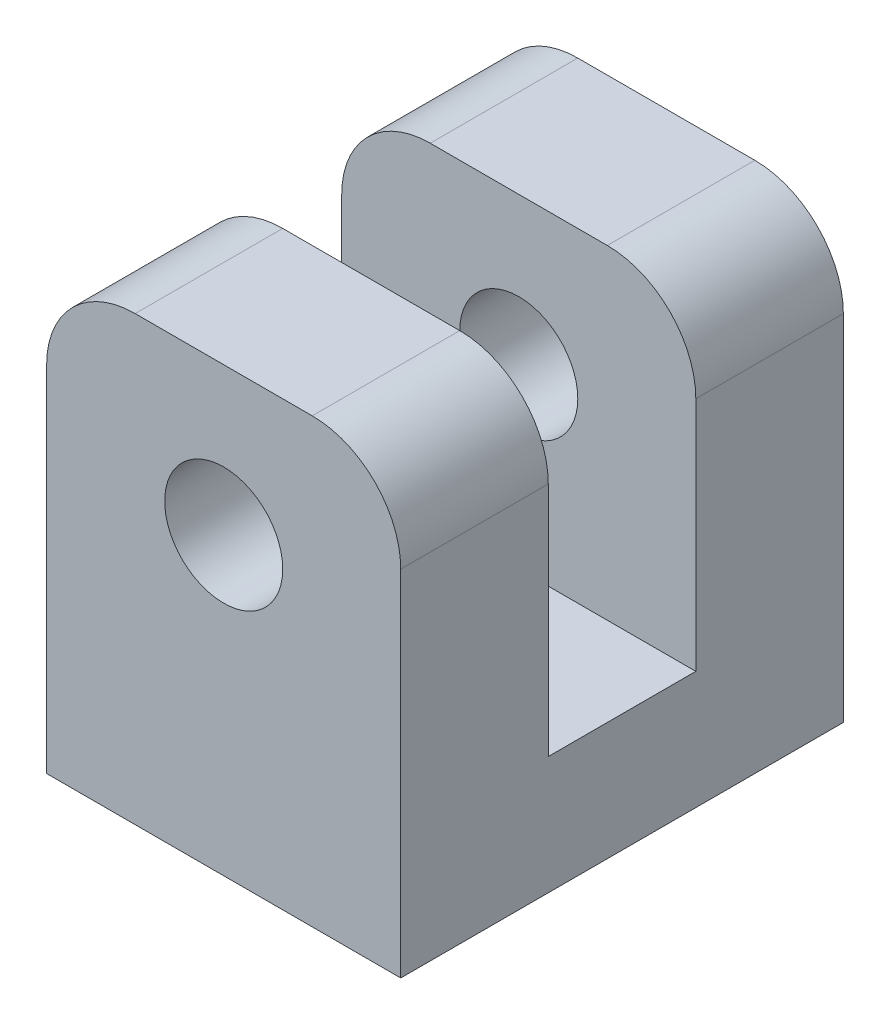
ISO-10303-21;
HEADER;
FILE_DESCRIPTION(('STEP AP214'),'2;1');
FILE_NAME('part.step','',(''),(''),'','','');
FILE_SCHEMA(('AUTOMOTIVE_DESIGN { 1 0 10303 214 1 1 1 1 }'));
ENDSEC;
DATA;
#1=APPLICATION_CONTEXT('core data for automotive mechanical design processes');
#2=APPLICATION_PROTOCOL_DEFINITION('international standard','automotive_design',2000,#1);
#3=PRODUCT_CONTEXT('',#1,'mechanical');
#4=PRODUCT('Part','Part','',(#3));
#5=PRODUCT_RELATED_PRODUCT_CATEGORY('part','',(#4));
#6=PRODUCT_DEFINITION_FORMATION('','',#4);
#7=PRODUCT_DEFINITION_CONTEXT('part definition',#1,'design');
#8=PRODUCT_DEFINITION('design','',#6,#7);
#9=PRODUCT_DEFINITION_SHAPE('','',#8);
#10=(LENGTH_UNIT() NAMED_UNIT(*) SI_UNIT(.MILLI.,.METRE.));
#11=(NAMED_UNIT(*) PLANE_ANGLE_UNIT() SI_UNIT($,.RADIAN.));
#12=(NAMED_UNIT(*) SI_UNIT($,.STERADIAN.) SOLID_ANGLE_UNIT());
#13=UNCERTAINTY_MEASURE_WITH_UNIT(LENGTH_MEASURE(1.E-05),#10,'distance_accuracy_value','');
#14=(GEOMETRIC_REPRESENTATION_CONTEXT(3) GLOBAL_UNCERTAINTY_ASSIGNED_CONTEXT((#13)) GLOBAL_UNIT_ASSIGNED_CONTEXT((#10,
#11,#12)) REPRESENTATION_CONTEXT('',''));
#15=CARTESIAN_POINT('',(0.,0.,0.));
#16=DIRECTION('',(0.,0.,1.));
#17=DIRECTION('',(1.,0.,0.));
#18=AXIS2_PLACEMENT_3D('',#15,#16,#17);
#19=CARTESIAN_POINT('',(0.,150.,150.));
#20=DIRECTION('',(0.,-1.,0.));
#21=DIRECTION('',(0.,0.,-1.));
#22=AXIS2_PLACEMENT_3D('',#19,#20,#21);
#23=PLANE('',#22);
#24=DIRECTION('',(-1.,0.,0.));
#25=VECTOR('',#24,1.);
#26=CARTESIAN_POINT('',(0.,150.,50.));
#27=LINE('',#26,#25);
#28=CARTESIAN_POINT('',(90.,150.,50.));
#29=VERTEX_POINT('',#28);
#30=CARTESIAN_POINT('',(30.,150.,50.));
#31=VERTEX_POINT('',#30);
#32=EDGE_CURVE('E143',#29,#31,#27,.T.);
#33=ORIENTED_EDGE('',*,*,#32,.F.);
#34=DIRECTION('',(0.,0.,-1.));
#35=VECTOR('',#34,1.);
#36=CARTESIAN_POINT('',(90.,150.,150.));
#37=LINE('',#36,#35);
#38=CARTESIAN_POINT('',(90.,150.,0.));
#39=VERTEX_POINT('',#38);
#40=EDGE_CURVE('E185',#29,#39,#37,.T.);
#41=ORIENTED_EDGE('',*,*,#40,.T.);
#42=DIRECTION('',(-1.,0.,0.));
#43=VECTOR('',#42,1.);
#44=CARTESIAN_POINT('',(0.,150.,0.));
#45=LINE('',#44,#43);
#46=CARTESIAN_POINT('',(30.,150.,0.));
#47=VERTEX_POINT('',#46);
#48=EDGE_CURVE('E155',#39,#47,#45,.T.);
#49=ORIENTED_EDGE('',*,*,#48,.T.);
#50=DIRECTION('',(0.,0.,-1.));
#51=VECTOR('',#50,1.);
#52=CARTESIAN_POINT('',(30.,150.,150.));
#53=LINE('',#52,#51);
#54=EDGE_CURVE('E178',#47,#31,#53,.F.);
#55=ORIENTED_EDGE('',*,*,#54,.T.);
#56=EDGE_LOOP('',(#33,#41,#49,#55));
#57=FACE_BOUND('',#56,.T.);
#58=ADVANCED_FACE('F33',(#57),#23,.F.);
#59=CARTESIAN_POINT('',(0.,0.,150.));
#60=DIRECTION('',(1.,0.,0.));
#61=DIRECTION('',(0.,0.,-1.));
#62=AXIS2_PLACEMENT_3D('',#59,#60,#61);
#63=PLANE('',#62);
#64=DIRECTION('',(0.,-1.,0.));
#65=VECTOR('',#64,1.);
#66=CARTESIAN_POINT('',(0.,0.,150.));
#67=LINE('',#66,#65);
#68=CARTESIAN_POINT('',(0.,120.,150.));
#69=VERTEX_POINT('',#68);
#70=CARTESIAN_POINT('',(0.,0.,150.));
#71=VERTEX_POINT('',#70);
#72=EDGE_CURVE('E152',#69,#71,#67,.T.);
#73=ORIENTED_EDGE('',*,*,#72,.F.);
#74=DIRECTION('',(0.,0.,-1.));
#75=VECTOR('',#74,1.);
#76=CARTESIAN_POINT('',(0.,120.,150.));
#77=LINE('',#76,#75);
#78=CARTESIAN_POINT('',(0.,120.,100.));
#79=VERTEX_POINT('',#78);
#80=EDGE_CURVE('E11',#69,#79,#77,.T.);
#81=ORIENTED_EDGE('',*,*,#80,.T.);
#82=DIRECTION('',(0.,1.,0.));
#83=VECTOR('',#82,1.);
#84=CARTESIAN_POINT('',(0.,40.,100.));
#85=LINE('',#84,#83);
#86=CARTESIAN_POINT('',(0.,40.,100.));
#87=VERTEX_POINT('',#86);
#88=EDGE_CURVE('E128',#87,#79,#85,.T.);
#89=ORIENTED_EDGE('',*,*,#88,.F.);
#90=DIRECTION('',(0.,0.,1.));
#91=VECTOR('',#90,1.);
#92=CARTESIAN_POINT('',(0.,40.,50.));
#93=LINE('',#92,#91);
#94=CARTESIAN_POINT('',(0.,40.,50.));
#95=VERTEX_POINT('',#94);
#96=EDGE_CURVE('E134',#95,#87,#93,.T.);
#97=ORIENTED_EDGE('',*,*,#96,.F.);
#98=DIRECTION('',(0.,1.,0.));
#99=VECTOR('',#98,1.);
#100=CARTESIAN_POINT('',(0.,40.,50.));
#101=LINE('',#100,#99);
#102=CARTESIAN_POINT('',(0.,120.,50.));
#103=VERTEX_POINT('',#102);
#104=EDGE_CURVE('E166',#95,#103,#101,.T.);
#105=ORIENTED_EDGE('',*,*,#104,.T.);
#106=DIRECTION('',(0.,0.,-1.));
#107=VECTOR('',#106,1.);
#108=CARTESIAN_POINT('',(0.,120.,150.));
#109=LINE('',#108,#107);
#110=CARTESIAN_POINT('',(0.,120.,0.));
#111=VERTEX_POINT('',#110);
#112=EDGE_CURVE('E41',#103,#111,#109,.T.);
#113=ORIENTED_EDGE('',*,*,#112,.T.);
#114=DIRECTION('',(0.,-1.,0.));
#115=VECTOR('',#114,1.);
#116=CARTESIAN_POINT('',(0.,0.,0.));
#117=LINE('',#116,#115);
#118=CARTESIAN_POINT('',(0.,0.,0.));
#119=VERTEX_POINT('',#118);
#120=EDGE_CURVE('E163',#111,#119,#117,.T.);
#121=ORIENTED_EDGE('',*,*,#120,.T.);
#122=DIRECTION('',(0.,0.,-1.));
#123=VECTOR('',#122,1.);
#124=CARTESIAN_POINT('',(0.,0.,150.));
#125=LINE('',#124,#123);
#126=EDGE_CURVE('E175',#71,#119,#125,.T.);
#127=ORIENTED_EDGE('',*,*,#126,.F.);
#128=EDGE_LOOP('',(#73,#81,#89,#97,#105,#113,#121,#127));
#129=FACE_BOUND('',#128,.T.);
#130=ADVANCED_FACE('F145',(#129),#63,.F.);
#131=CARTESIAN_POINT('',(0.,0.,150.));
#132=DIRECTION('',(0.,1.,0.));
#133=DIRECTION('',(0.,0.,1.));
#134=AXIS2_PLACEMENT_3D('',#131,#132,#133);
#135=PLANE('',#134);
#136=CARTESIAN_POINT('',(60.,0.,75.));
#137=DIRECTION('',(0.,-1.,0.));
#138=DIRECTION('',(0.,0.,-1.));
#139=AXIS2_PLACEMENT_3D('',#136,#137,#138);
#140=CIRCLE('',#139,30.);
#141=CARTESIAN_POINT('',(60.,0.,45.));
#142=VERTEX_POINT('',#141);
#143=EDGE_CURVE('E266',#142,#142,#140,.T.);
#144=ORIENTED_EDGE('',*,*,#143,.F.);
#145=EDGE_LOOP('',(#144));
#146=FACE_BOUND('',#145,.T.);
#147=DIRECTION('',(1.,0.,0.));
#148=VECTOR('',#147,1.);
#149=CARTESIAN_POINT('',(0.,0.,0.));
#150=LINE('',#149,#148);
#151=CARTESIAN_POINT('',(120.,0.,0.));
#152=VERTEX_POINT('',#151);
#153=EDGE_CURVE('E165',#119,#152,#150,.T.);
#154=ORIENTED_EDGE('',*,*,#153,.T.);
#155=DIRECTION('',(0.,0.,-1.));
#156=VECTOR('',#155,1.);
#157=CARTESIAN_POINT('',(120.,0.,150.));
#158=LINE('',#157,#156);
#159=CARTESIAN_POINT('',(120.,0.,150.));
#160=VERTEX_POINT('',#159);
#161=EDGE_CURVE('E162',#160,#152,#158,.T.);
#162=ORIENTED_EDGE('',*,*,#161,.F.);
#163=DIRECTION('',(1.,0.,0.));
#164=VECTOR('',#163,1.);
#165=CARTESIAN_POINT('',(0.,0.,150.));
#166=LINE('',#165,#164);
#167=EDGE_CURVE('E154',#71,#160,#166,.T.);
#168=ORIENTED_EDGE('',*,*,#167,.F.);
#169=ORIENTED_EDGE('',*,*,#126,.T.);
#170=EDGE_LOOP('',(#154,#162,#168,#169));
#171=FACE_BOUND('',#170,.T.);
#172=ADVANCED_FACE('F224',(#146,#171),#135,.F.);
#173=CARTESIAN_POINT('',(120.,0.,150.));
#174=DIRECTION('',(-1.,0.,0.));
#175=DIRECTION('',(0.,0.,1.));
#176=AXIS2_PLACEMENT_3D('',#173,#174,#175);
#177=PLANE('',#176);
#178=DIRECTION('',(0.,1.,0.));
#179=VECTOR('',#178,1.);
#180=CARTESIAN_POINT('',(120.,0.,0.));
#181=LINE('',#180,#179);
#182=CARTESIAN_POINT('',(120.,120.,0.));
#183=VERTEX_POINT('',#182);
#184=EDGE_CURVE('E168',#152,#183,#181,.T.);
#185=ORIENTED_EDGE('',*,*,#184,.T.);
#186=DIRECTION('',(0.,0.,-1.));
#187=VECTOR('',#186,1.);
#188=CARTESIAN_POINT('',(120.,120.,150.));
#189=LINE('',#188,#187);
#190=CARTESIAN_POINT('',(120.,120.,50.));
#191=VERTEX_POINT('',#190);
#192=EDGE_CURVE('E194',#183,#191,#189,.F.);
#193=ORIENTED_EDGE('',*,*,#192,.T.);
#194=DIRECTION('',(0.,1.,0.));
#195=VECTOR('',#194,1.);
#196=CARTESIAN_POINT('',(120.,40.,50.));
#197=LINE('',#196,#195);
#198=CARTESIAN_POINT('',(120.,40.,50.));
#199=VERTEX_POINT('',#198);
#200=EDGE_CURVE('E147',#199,#191,#197,.T.);
#201=ORIENTED_EDGE('',*,*,#200,.F.);
#202=DIRECTION('',(0.,0.,-1.));
#203=VECTOR('',#202,1.);
#204=CARTESIAN_POINT('',(120.,40.,50.));
#205=LINE('',#204,#203);
#206=CARTESIAN_POINT('',(120.,40.,100.));
#207=VERTEX_POINT('',#206);
#208=EDGE_CURVE('E133',#207,#199,#205,.T.);
#209=ORIENTED_EDGE('',*,*,#208,.F.);
#210=DIRECTION('',(0.,1.,0.));
#211=VECTOR('',#210,1.);
#212=CARTESIAN_POINT('',(120.,40.,100.));
#213=LINE('',#212,#211);
#214=CARTESIAN_POINT('',(120.,120.,100.));
#215=VERTEX_POINT('',#214);
#216=EDGE_CURVE('E130',#207,#215,#213,.T.);
#217=ORIENTED_EDGE('',*,*,#216,.T.);
#218=DIRECTION('',(0.,0.,-1.));
#219=VECTOR('',#218,1.);
#220=CARTESIAN_POINT('',(120.,120.,150.));
#221=LINE('',#220,#219);
#222=CARTESIAN_POINT('',(120.,120.,150.));
#223=VERTEX_POINT('',#222);
#224=EDGE_CURVE('E192',#215,#223,#221,.F.);
#225=ORIENTED_EDGE('',*,*,#224,.T.);
#226=DIRECTION('',(0.,1.,0.));
#227=VECTOR('',#226,1.);
#228=CARTESIAN_POINT('',(120.,0.,150.));
#229=LINE('',#228,#227);
#230=EDGE_CURVE('E157',#160,#223,#229,.T.);
#231=ORIENTED_EDGE('',*,*,#230,.F.);
#232=ORIENTED_EDGE('',*,*,#161,.T.);
#233=EDGE_LOOP('',(#185,#193,#201,#209,#217,#225,#231,#232));
#234=FACE_BOUND('',#233,.T.);
#235=ADVANCED_FACE('F258',(#234),#177,.F.);
#236=DIRECTION('',(-1.,0.,0.));
#237=VECTOR('',#236,1.);
#238=CARTESIAN_POINT('',(0.,150.,150.));
#239=LINE('',#238,#237);
#240=CARTESIAN_POINT('',(90.,150.,150.));
#241=VERTEX_POINT('',#240);
#242=CARTESIAN_POINT('',(30.,150.,150.));
#243=VERTEX_POINT('',#242);
#244=EDGE_CURVE('E160',#241,#243,#239,.T.);
#245=ORIENTED_EDGE('',*,*,#244,.F.);
#246=DIRECTION('',(0.,0.,-1.));
#247=VECTOR('',#246,1.);
#248=CARTESIAN_POINT('',(90.,150.,150.));
#249=LINE('',#248,#247);
#250=CARTESIAN_POINT('',(90.,150.,100.));
#251=VERTEX_POINT('',#250);
#252=EDGE_CURVE('E202',#241,#251,#249,.T.);
#253=ORIENTED_EDGE('',*,*,#252,.T.);
#254=DIRECTION('',(1.,0.,0.));
#255=VECTOR('',#254,1.);
#256=CARTESIAN_POINT('',(0.,150.,100.));
#257=LINE('',#256,#255);
#258=CARTESIAN_POINT('',(30.,150.,100.));
#259=VERTEX_POINT('',#258);
#260=EDGE_CURVE('E231',#259,#251,#257,.T.);
#261=ORIENTED_EDGE('',*,*,#260,.F.);
#262=DIRECTION('',(0.,0.,-1.));
#263=VECTOR('',#262,1.);
#264=CARTESIAN_POINT('',(30.,150.,150.));
#265=LINE('',#264,#263);
#266=EDGE_CURVE('E200',#259,#243,#265,.F.);
#267=ORIENTED_EDGE('',*,*,#266,.T.);
#268=EDGE_LOOP('',(#245,#253,#261,#267));
#269=FACE_BOUND('',#268,.T.);
#270=ADVANCED_FACE('F229',(#269),#23,.F.);
#271=CARTESIAN_POINT('',(0.,150.,150.));
#272=DIRECTION('',(0.,0.,-1.));
#273=DIRECTION('',(-1.,0.,0.));
#274=AXIS2_PLACEMENT_3D('',#271,#272,#273);
#275=PLANE('',#274);
#276=CARTESIAN_POINT('',(60.,100.,150.));
#277=DIRECTION('',(0.,0.,1.));
#278=DIRECTION('',(1.,0.,0.));
#279=AXIS2_PLACEMENT_3D('',#276,#277,#278);
#280=CIRCLE('',#279,20.);
#281=CARTESIAN_POINT('',(80.,100.,150.));
#282=VERTEX_POINT('',#281);
#283=EDGE_CURVE('E260',#282,#282,#280,.T.);
#284=ORIENTED_EDGE('',*,*,#283,.F.);
#285=EDGE_LOOP('',(#284));
#286=FACE_BOUND('',#285,.T.);
#287=ORIENTED_EDGE('',*,*,#230,.T.);
#288=CARTESIAN_POINT('',(90.,120.,150.));
#289=DIRECTION('',(0.,0.,-1.));
#290=DIRECTION('',(-1.,0.,0.));
#291=AXIS2_PLACEMENT_3D('',#288,#289,#290);
#292=CIRCLE('',#291,30.);
#293=EDGE_CURVE('E209',#223,#241,#292,.F.);
#294=ORIENTED_EDGE('',*,*,#293,.T.);
#295=ORIENTED_EDGE('',*,*,#244,.T.);
#296=CARTESIAN_POINT('',(30.,120.,150.));
#297=DIRECTION('',(0.,0.,-1.));
#298=DIRECTION('',(-1.,0.,0.));
#299=AXIS2_PLACEMENT_3D('',#296,#297,#298);
#300=CIRCLE('',#299,30.);
#301=EDGE_CURVE('E48',#243,#69,#300,.F.);
#302=ORIENTED_EDGE('',*,*,#301,.T.);
#303=ORIENTED_EDGE('',*,*,#72,.T.);
#304=ORIENTED_EDGE('',*,*,#167,.T.);
#305=EDGE_LOOP('',(#287,#294,#295,#302,#303,#304));
#306=FACE_BOUND('',#305,.T.);
#307=ADVANCED_FACE('F232',(#286,#306),#275,.F.);
#308=CARTESIAN_POINT('',(0.,150.,0.));
#309=DIRECTION('',(0.,0.,-1.));
#310=DIRECTION('',(-1.,0.,0.));
#311=AXIS2_PLACEMENT_3D('',#308,#309,#310);
#312=PLANE('',#311);
#313=CARTESIAN_POINT('',(60.,100.,0.));
#314=DIRECTION('',(0.,0.,1.));
#315=DIRECTION('',(1.,0.,0.));
#316=AXIS2_PLACEMENT_3D('',#313,#314,#315);
#317=CIRCLE('',#316,20.);
#318=CARTESIAN_POINT('',(80.,100.,0.));
#319=VERTEX_POINT('',#318);
#320=EDGE_CURVE('E183',#319,#319,#317,.T.);
#321=ORIENTED_EDGE('',*,*,#320,.T.);
#322=EDGE_LOOP('',(#321));
#323=FACE_BOUND('',#322,.T.);
#324=ORIENTED_EDGE('',*,*,#48,.F.);
#325=CARTESIAN_POINT('',(90.,120.,0.));
#326=DIRECTION('',(0.,0.,-1.));
#327=DIRECTION('',(-1.,0.,0.));
#328=AXIS2_PLACEMENT_3D('',#325,#326,#327);
#329=CIRCLE('',#328,30.);
#330=EDGE_CURVE('E190',#39,#183,#329,.T.);
#331=ORIENTED_EDGE('',*,*,#330,.T.);
#332=ORIENTED_EDGE('',*,*,#184,.F.);
#333=ORIENTED_EDGE('',*,*,#153,.F.);
#334=ORIENTED_EDGE('',*,*,#120,.F.);
#335=CARTESIAN_POINT('',(30.,120.,0.));
#336=DIRECTION('',(0.,0.,-1.));
#337=DIRECTION('',(-1.,0.,0.));
#338=AXIS2_PLACEMENT_3D('',#335,#336,#337);
#339=CIRCLE('',#338,30.);
#340=EDGE_CURVE('E188',#111,#47,#339,.T.);
#341=ORIENTED_EDGE('',*,*,#340,.T.);
#342=EDGE_LOOP('',(#324,#331,#332,#333,#334,#341));
#343=FACE_BOUND('',#342,.T.);
#344=ADVANCED_FACE('F219',(#323,#343),#312,.T.);
#345=CARTESIAN_POINT('',(0.,40.,50.));
#346=DIRECTION('',(0.,0.,-1.));
#347=DIRECTION('',(-1.,0.,0.));
#348=AXIS2_PLACEMENT_3D('',#345,#346,#347);
#349=PLANE('',#348);
#350=CARTESIAN_POINT('',(60.,100.,50.));
#351=DIRECTION('',(0.,0.,-1.));
#352=DIRECTION('',(-1.,0.,0.));
#353=AXIS2_PLACEMENT_3D('',#350,#351,#352);
#354=CIRCLE('',#353,20.);
#355=CARTESIAN_POINT('',(40.,100.,50.));
#356=VERTEX_POINT('',#355);
#357=EDGE_CURVE('E182',#356,#356,#354,.T.);
#358=ORIENTED_EDGE('',*,*,#357,.T.);
#359=EDGE_LOOP('',(#358));
#360=FACE_BOUND('',#359,.T.);
#361=ORIENTED_EDGE('',*,*,#200,.T.);
#362=CARTESIAN_POINT('',(90.,120.,50.));
#363=DIRECTION('',(0.,0.,-1.));
#364=DIRECTION('',(-1.,0.,0.));
#365=AXIS2_PLACEMENT_3D('',#362,#363,#364);
#366=CIRCLE('',#365,30.);
#367=EDGE_CURVE('E198',#191,#29,#366,.F.);
#368=ORIENTED_EDGE('',*,*,#367,.T.);
#369=ORIENTED_EDGE('',*,*,#32,.T.);
#370=CARTESIAN_POINT('',(30.,120.,50.));
#371=DIRECTION('',(0.,0.,-1.));
#372=DIRECTION('',(-1.,0.,0.));
#373=AXIS2_PLACEMENT_3D('',#370,#371,#372);
#374=CIRCLE('',#373,30.);
#375=EDGE_CURVE('E196',#31,#103,#374,.F.);
#376=ORIENTED_EDGE('',*,*,#375,.T.);
#377=ORIENTED_EDGE('',*,*,#104,.F.);
#378=DIRECTION('',(-1.,0.,0.));
#379=VECTOR('',#378,1.);
#380=CARTESIAN_POINT('',(0.,40.,50.));
#381=LINE('',#380,#379);
#382=EDGE_CURVE('E140',#199,#95,#381,.T.);
#383=ORIENTED_EDGE('',*,*,#382,.F.);
#384=EDGE_LOOP('',(#361,#368,#369,#376,#377,#383));
#385=FACE_BOUND('',#384,.T.);
#386=ADVANCED_FACE('F249',(#360,#385),#349,.F.);
#387=CARTESIAN_POINT('',(0.,40.,100.));
#388=DIRECTION('',(0.,0.,1.));
#389=DIRECTION('',(1.,0.,0.));
#390=AXIS2_PLACEMENT_3D('',#387,#388,#389);
#391=PLANE('',#390);
#392=CARTESIAN_POINT('',(60.,100.,100.));
#393=DIRECTION('',(0.,0.,1.));
#394=DIRECTION('',(1.,0.,0.));
#395=AXIS2_PLACEMENT_3D('',#392,#393,#394);
#396=CIRCLE('',#395,20.);
#397=CARTESIAN_POINT('',(80.,100.,100.));
#398=VERTEX_POINT('',#397);
#399=EDGE_CURVE('E179',#398,#398,#396,.T.);
#400=ORIENTED_EDGE('',*,*,#399,.T.);
#401=EDGE_LOOP('',(#400));
#402=FACE_BOUND('',#401,.T.);
#403=ORIENTED_EDGE('',*,*,#260,.T.);
#404=CARTESIAN_POINT('',(90.,120.,100.));
#405=DIRECTION('',(0.,0.,1.));
#406=DIRECTION('',(1.,0.,0.));
#407=AXIS2_PLACEMENT_3D('',#404,#405,#406);
#408=CIRCLE('',#407,30.);
#409=EDGE_CURVE('E206',#251,#215,#408,.F.);
#410=ORIENTED_EDGE('',*,*,#409,.T.);
#411=ORIENTED_EDGE('',*,*,#216,.F.);
#412=DIRECTION('',(1.,0.,0.));
#413=VECTOR('',#412,1.);
#414=CARTESIAN_POINT('',(0.,40.,100.));
#415=LINE('',#414,#413);
#416=EDGE_CURVE('E123',#87,#207,#415,.T.);
#417=ORIENTED_EDGE('',*,*,#416,.F.);
#418=ORIENTED_EDGE('',*,*,#88,.T.);
#419=CARTESIAN_POINT('',(30.,120.,100.));
#420=DIRECTION('',(0.,0.,1.));
#421=DIRECTION('',(1.,0.,0.));
#422=AXIS2_PLACEMENT_3D('',#419,#420,#421);
#423=CIRCLE('',#422,30.);
#424=EDGE_CURVE('E56',#79,#259,#423,.F.);
#425=ORIENTED_EDGE('',*,*,#424,.T.);
#426=EDGE_LOOP('',(#403,#410,#411,#417,#418,#425));
#427=FACE_BOUND('',#426,.T.);
#428=ADVANCED_FACE('F126',(#402,#427),#391,.F.);
#429=CARTESIAN_POINT('',(0.,40.,100.));
#430=DIRECTION('',(0.,1.,0.));
#431=DIRECTION('',(0.,0.,1.));
#432=AXIS2_PLACEMENT_3D('',#429,#430,#431);
#433=PLANE('',#432);
#434=ORIENTED_EDGE('',*,*,#96,.T.);
#435=ORIENTED_EDGE('',*,*,#416,.T.);
#436=ORIENTED_EDGE('',*,*,#208,.T.);
#437=ORIENTED_EDGE('',*,*,#382,.T.);
#438=EDGE_LOOP('',(#434,#435,#436,#437));
#439=FACE_BOUND('',#438,.T.);
#440=ADVANCED_FACE('F138',(#439),#433,.T.);
#441=CARTESIAN_POINT('',(60.,100.,0.));
#442=DIRECTION('',(0.,0.,1.));
#443=DIRECTION('',(1.,0.,0.));
#444=AXIS2_PLACEMENT_3D('',#441,#442,#443);
#445=CYLINDRICAL_SURFACE('',#444,20.);
#446=ORIENTED_EDGE('',*,*,#283,.T.);
#447=EDGE_LOOP('',(#446));
#448=FACE_BOUND('',#447,.T.);
#449=ORIENTED_EDGE('',*,*,#399,.F.);
#450=EDGE_LOOP('',(#449));
#451=FACE_BOUND('',#450,.T.);
#452=ADVANCED_FACE('F314',(#448,#451),#445,.F.);
#453=ORIENTED_EDGE('',*,*,#320,.F.);
#454=EDGE_LOOP('',(#453));
#455=FACE_BOUND('',#454,.T.);
#456=ORIENTED_EDGE('',*,*,#357,.F.);
#457=EDGE_LOOP('',(#456));
#458=FACE_BOUND('',#457,.T.);
#459=ADVANCED_FACE('F277',(#455,#458),#445,.F.);
#460=CARTESIAN_POINT('',(60.,35.,75.));
#461=DIRECTION('',(0.,-1.,0.));
#462=DIRECTION('',(0.,0.,-1.));
#463=AXIS2_PLACEMENT_3D('',#460,#461,#462);
#464=CYLINDRICAL_SURFACE('',#463,30.);
#465=CARTESIAN_POINT('',(60.,35.,75.));
#466=DIRECTION('',(0.,-1.,0.));
#467=DIRECTION('',(0.,0.,-1.));
#468=AXIS2_PLACEMENT_3D('',#465,#466,#467);
#469=CIRCLE('',#468,30.);
#470=CARTESIAN_POINT('',(60.,35.,45.));
#471=VERTEX_POINT('',#470);
#472=EDGE_CURVE('E263',#471,#471,#469,.T.);
#473=ORIENTED_EDGE('',*,*,#472,.F.);
#474=EDGE_LOOP('',(#473));
#475=FACE_BOUND('',#474,.T.);
#476=ORIENTED_EDGE('',*,*,#143,.T.);
#477=EDGE_LOOP('',(#476));
#478=FACE_BOUND('',#477,.T.);
#479=ADVANCED_FACE('F274',(#475,#478),#464,.F.);
#480=CARTESIAN_POINT('',(60.,35.,75.));
#481=DIRECTION('',(0.,-1.,0.));
#482=DIRECTION('',(0.,0.,-1.));
#483=AXIS2_PLACEMENT_3D('',#480,#481,#482);
#484=PLANE('',#483);
#485=ORIENTED_EDGE('',*,*,#472,.T.);
#486=EDGE_LOOP('',(#485));
#487=FACE_BOUND('',#486,.T.);
#488=ADVANCED_FACE('F272',(#487),#484,.T.);
#489=CARTESIAN_POINT('',(90.,120.,150.));
#490=DIRECTION('',(0.,0.,-1.));
#491=DIRECTION('',(-1.,0.,0.));
#492=AXIS2_PLACEMENT_3D('',#489,#490,#491);
#493=CYLINDRICAL_SURFACE('',#492,30.);
#494=ORIENTED_EDGE('',*,*,#367,.F.);
#495=ORIENTED_EDGE('',*,*,#192,.F.);
#496=ORIENTED_EDGE('',*,*,#330,.F.);
#497=ORIENTED_EDGE('',*,*,#40,.F.);
#498=EDGE_LOOP('',(#494,#495,#496,#497));
#499=FACE_BOUND('',#498,.T.);
#500=ADVANCED_FACE('F255',(#499),#493,.T.);
#501=CARTESIAN_POINT('',(90.,120.,150.));
#502=DIRECTION('',(0.,0.,-1.));
#503=DIRECTION('',(-1.,0.,0.));
#504=AXIS2_PLACEMENT_3D('',#501,#502,#503);
#505=CYLINDRICAL_SURFACE('',#504,30.);
#506=ORIENTED_EDGE('',*,*,#293,.F.);
#507=ORIENTED_EDGE('',*,*,#224,.F.);
#508=ORIENTED_EDGE('',*,*,#409,.F.);
#509=ORIENTED_EDGE('',*,*,#252,.F.);
#510=EDGE_LOOP('',(#506,#507,#508,#509));
#511=FACE_BOUND('',#510,.T.);
#512=ADVANCED_FACE('F237',(#511),#505,.T.);
#513=CARTESIAN_POINT('',(30.,120.,150.));
#514=DIRECTION('',(0.,0.,-1.));
#515=DIRECTION('',(-1.,0.,0.));
#516=AXIS2_PLACEMENT_3D('',#513,#514,#515);
#517=CYLINDRICAL_SURFACE('',#516,30.);
#518=ORIENTED_EDGE('',*,*,#301,.F.);
#519=ORIENTED_EDGE('',*,*,#266,.F.);
#520=ORIENTED_EDGE('',*,*,#424,.F.);
#521=ORIENTED_EDGE('',*,*,#80,.F.);
#522=EDGE_LOOP('',(#518,#519,#520,#521));
#523=FACE_BOUND('',#522,.T.);
#524=ADVANCED_FACE('F225',(#523),#517,.T.);
#525=CARTESIAN_POINT('',(30.,120.,150.));
#526=DIRECTION('',(0.,0.,-1.));
#527=DIRECTION('',(-1.,0.,0.));
#528=AXIS2_PLACEMENT_3D('',#525,#526,#527);
#529=CYLINDRICAL_SURFACE('',#528,30.);
#530=ORIENTED_EDGE('',*,*,#375,.F.);
#531=ORIENTED_EDGE('',*,*,#54,.F.);
#532=ORIENTED_EDGE('',*,*,#340,.F.);
#533=ORIENTED_EDGE('',*,*,#112,.F.);
#534=EDGE_LOOP('',(#530,#531,#532,#533));
#535=FACE_BOUND('',#534,.T.);
#536=ADVANCED_FACE('F35',(#535),#529,.T.);
#537=CLOSED_SHELL('',(#58,#130,#172,#235,#270,#307,#344,#386,#428,#440,#452,#459,#479,#488,#500,
#512,#524,#536));
#538=MANIFOLD_SOLID_BREP('B2',#537);
#539=ADVANCED_BREP_SHAPE_REPRESENTATION('',(#18,#538),#14);
#540=SHAPE_DEFINITION_REPRESENTATION(#9,#539);
ENDSEC;
END-ISO-10303-21;
